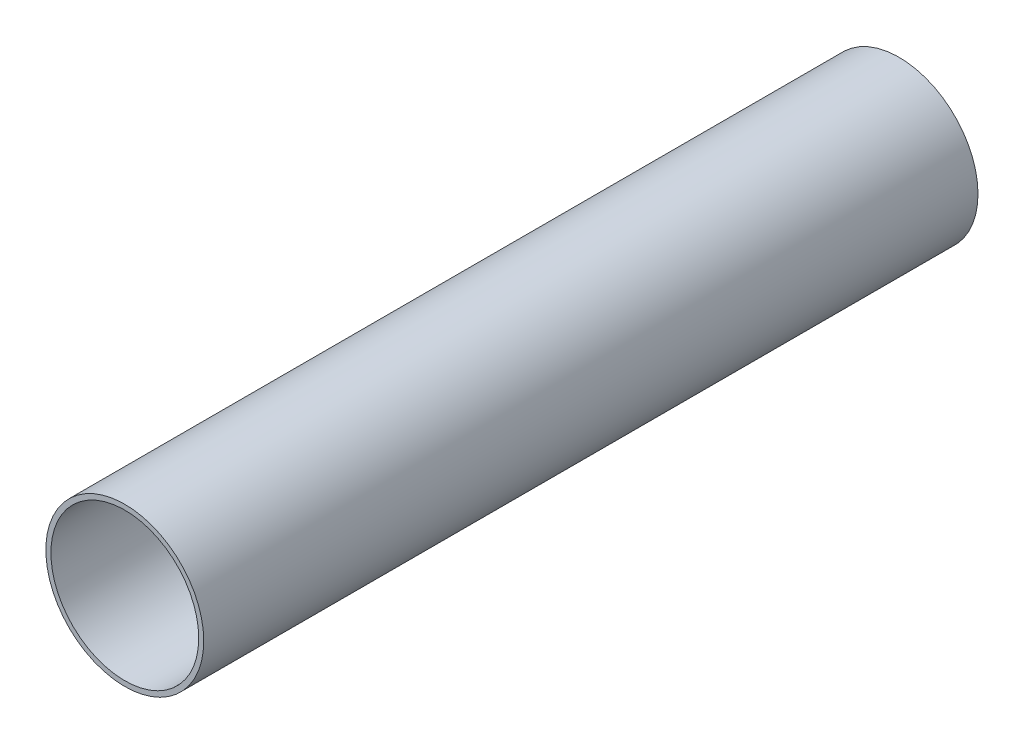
from build123d import *

# Parameters (mm, degrees)
SKETCH1_R           = 47
BOSS_EXTRUDE1_DEPTH = 460.889148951
SHELL1_T            = -3


with BuildPart() as part:
    # Sketch1 → Boss-Extrude1 (new body)
    with BuildSketch(Plane.XY):
        with Locations((-395, 0)):
            Circle(SKETCH1_R)
    extrude(amount=BOSS_EXTRUDE1_DEPTH)

    # Shell1
    shell1_openings = [part.faces().sort_by_distance(p)[0] for p in [
        (-395, 0, 460.889148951),
    ]]
    offset(amount=SHELL1_T, openings=shell1_openings, kind=Kind.INTERSECTION)


solid = part.part
